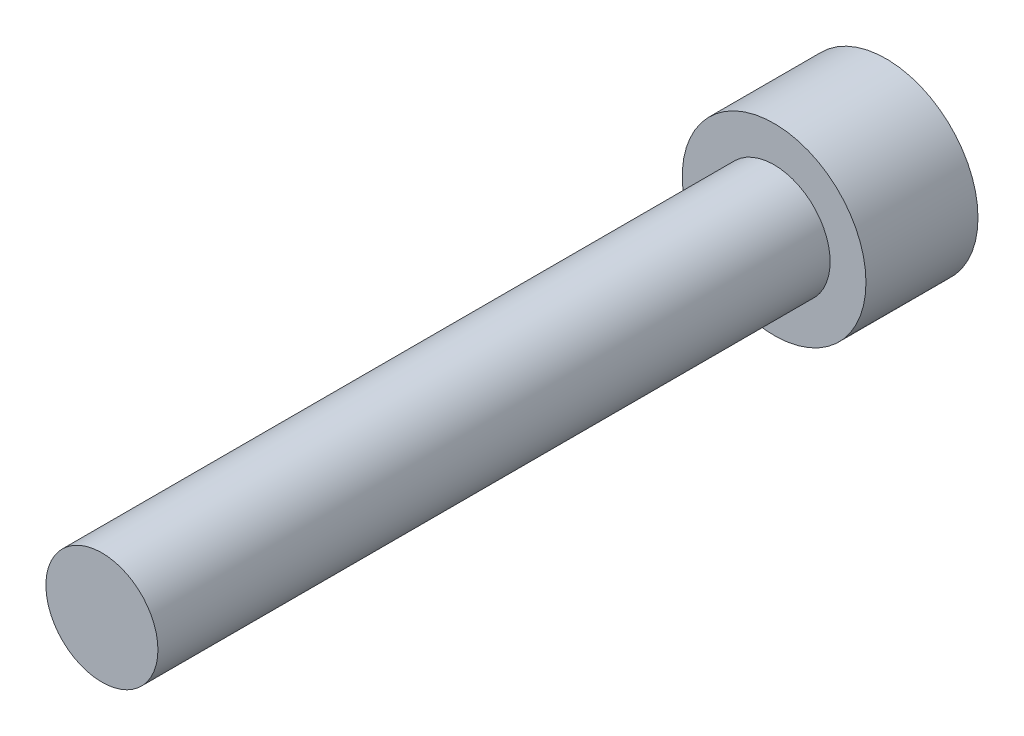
ISO-10303-21;
HEADER;
FILE_DESCRIPTION(('STEP AP214'),'2;1');
FILE_NAME('part.step','',(''),(''),'','','');
FILE_SCHEMA(('AUTOMOTIVE_DESIGN { 1 0 10303 214 1 1 1 1 }'));
ENDSEC;
DATA;
#1=APPLICATION_CONTEXT('core data for automotive mechanical design processes');
#2=APPLICATION_PROTOCOL_DEFINITION('international standard','automotive_design',2000,#1);
#3=PRODUCT_CONTEXT('',#1,'mechanical');
#4=PRODUCT('Part','Part','',(#3));
#5=PRODUCT_RELATED_PRODUCT_CATEGORY('part','',(#4));
#6=PRODUCT_DEFINITION_FORMATION('','',#4);
#7=PRODUCT_DEFINITION_CONTEXT('part definition',#1,'design');
#8=PRODUCT_DEFINITION('design','',#6,#7);
#9=PRODUCT_DEFINITION_SHAPE('','',#8);
#10=(LENGTH_UNIT() NAMED_UNIT(*) SI_UNIT(.MILLI.,.METRE.));
#11=(NAMED_UNIT(*) PLANE_ANGLE_UNIT() SI_UNIT($,.RADIAN.));
#12=(NAMED_UNIT(*) SI_UNIT($,.STERADIAN.) SOLID_ANGLE_UNIT());
#13=UNCERTAINTY_MEASURE_WITH_UNIT(LENGTH_MEASURE(1.E-05),#10,'distance_accuracy_value','');
#14=(GEOMETRIC_REPRESENTATION_CONTEXT(3) GLOBAL_UNCERTAINTY_ASSIGNED_CONTEXT((#13)) GLOBAL_UNIT_ASSIGNED_CONTEXT((#10,
#11,#12)) REPRESENTATION_CONTEXT('',''));
#15=CARTESIAN_POINT('',(0.,0.,0.));
#16=DIRECTION('',(0.,0.,1.));
#17=DIRECTION('',(1.,0.,0.));
#18=AXIS2_PLACEMENT_3D('',#15,#16,#17);
#19=CARTESIAN_POINT('',(0.,0.,19.05));
#20=DIRECTION('',(0.,0.,1.));
#21=DIRECTION('',(1.,0.,0.));
#22=AXIS2_PLACEMENT_3D('',#19,#20,#21);
#23=PLANE('',#22);
#24=CARTESIAN_POINT('',(0.,0.,19.05));
#25=DIRECTION('',(0.,0.,1.));
#26=DIRECTION('',(1.,0.,0.));
#27=AXIS2_PLACEMENT_3D('',#24,#25,#26);
#28=CIRCLE('',#27,1.5875);
#29=CARTESIAN_POINT('',(1.5875,0.,19.05));
#30=VERTEX_POINT('',#29);
#31=EDGE_CURVE('E11',#30,#30,#28,.T.);
#32=ORIENTED_EDGE('',*,*,#31,.T.);
#33=EDGE_LOOP('',(#32));
#34=FACE_BOUND('',#33,.T.);
#35=ADVANCED_FACE('F37',(#34),#23,.T.);
#36=CARTESIAN_POINT('',(0.,0.,19.05));
#37=DIRECTION('',(0.,0.,1.));
#38=DIRECTION('',(1.,0.,0.));
#39=AXIS2_PLACEMENT_3D('',#36,#37,#38);
#40=CYLINDRICAL_SURFACE('',#39,1.5875);
#41=CARTESIAN_POINT('',(0.,0.,0.));
#42=DIRECTION('',(0.,0.,1.));
#43=DIRECTION('',(1.,0.,0.));
#44=AXIS2_PLACEMENT_3D('',#41,#42,#43);
#45=CIRCLE('',#44,1.5875);
#46=CARTESIAN_POINT('',(1.5875,0.,0.));
#47=VERTEX_POINT('',#46);
#48=EDGE_CURVE('E44',#47,#47,#45,.T.);
#49=ORIENTED_EDGE('',*,*,#48,.T.);
#50=EDGE_LOOP('',(#49));
#51=FACE_BOUND('',#50,.T.);
#52=ORIENTED_EDGE('',*,*,#31,.F.);
#53=EDGE_LOOP('',(#52));
#54=FACE_BOUND('',#53,.T.);
#55=ADVANCED_FACE('F151',(#51,#54),#40,.T.);
#56=CARTESIAN_POINT('',(0.,-1.5875,0.));
#57=DIRECTION('',(0.,0.,1.));
#58=DIRECTION('',(1.,0.,0.));
#59=AXIS2_PLACEMENT_3D('',#56,#57,#58);
#60=PLANE('',#59);
#61=CARTESIAN_POINT('',(0.,0.,0.));
#62=DIRECTION('',(0.,0.,1.));
#63=DIRECTION('',(1.,0.,0.));
#64=AXIS2_PLACEMENT_3D('',#61,#62,#63);
#65=CIRCLE('',#64,2.6035);
#66=CARTESIAN_POINT('',(2.6035,0.,0.));
#67=VERTEX_POINT('',#66);
#68=EDGE_CURVE('E146',#67,#67,#65,.T.);
#69=ORIENTED_EDGE('',*,*,#68,.T.);
#70=EDGE_LOOP('',(#69));
#71=FACE_BOUND('',#70,.T.);
#72=ORIENTED_EDGE('',*,*,#48,.F.);
#73=EDGE_LOOP('',(#72));
#74=FACE_BOUND('',#73,.T.);
#75=ADVANCED_FACE('F154',(#71,#74),#60,.T.);
#76=CARTESIAN_POINT('',(0.,0.,19.05));
#77=DIRECTION('',(0.,0.,1.));
#78=DIRECTION('',(1.,0.,0.));
#79=AXIS2_PLACEMENT_3D('',#76,#77,#78);
#80=CYLINDRICAL_SURFACE('',#79,2.6035);
#81=CARTESIAN_POINT('',(0.,0.,-3.175));
#82=DIRECTION('',(0.,0.,1.));
#83=DIRECTION('',(1.,0.,0.));
#84=AXIS2_PLACEMENT_3D('',#81,#82,#83);
#85=CIRCLE('',#84,2.6035);
#86=CARTESIAN_POINT('',(2.6035,0.,-3.175));
#87=VERTEX_POINT('',#86);
#88=EDGE_CURVE('E138',#87,#87,#85,.T.);
#89=ORIENTED_EDGE('',*,*,#88,.T.);
#90=EDGE_LOOP('',(#89));
#91=FACE_BOUND('',#90,.T.);
#92=ORIENTED_EDGE('',*,*,#68,.F.);
#93=EDGE_LOOP('',(#92));
#94=FACE_BOUND('',#93,.T.);
#95=ADVANCED_FACE('F156',(#91,#94),#80,.T.);
#96=CARTESIAN_POINT('',(0.,-2.6035,-3.175));
#97=DIRECTION('',(0.,0.,-1.));
#98=DIRECTION('',(-1.,0.,0.));
#99=AXIS2_PLACEMENT_3D('',#96,#97,#98);
#100=PLANE('',#99);
#101=DIRECTION('',(0.866025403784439,-0.5,0.));
#102=VECTOR('',#101,1.);
#103=CARTESIAN_POINT('',(0.,1.36381680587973,-3.175));
#104=LINE('',#103,#102);
#105=CARTESIAN_POINT('',(0.,1.36381680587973,-3.175));
#106=VERTEX_POINT('',#105);
#107=CARTESIAN_POINT('',(1.1811,0.681908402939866,-3.175));
#108=VERTEX_POINT('',#107);
#109=EDGE_CURVE('E51',#106,#108,#104,.T.);
#110=ORIENTED_EDGE('',*,*,#109,.F.);
#111=DIRECTION('',(0.866025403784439,0.5,0.));
#112=VECTOR('',#111,1.);
#113=CARTESIAN_POINT('',(-1.1811,0.681908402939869,-3.175));
#114=LINE('',#113,#112);
#115=CARTESIAN_POINT('',(-1.1811,0.681908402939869,-3.175));
#116=VERTEX_POINT('',#115);
#117=EDGE_CURVE('E134',#116,#106,#114,.T.);
#118=ORIENTED_EDGE('',*,*,#117,.F.);
#119=DIRECTION('',(0.,1.,0.));
#120=VECTOR('',#119,1.);
#121=CARTESIAN_POINT('',(-1.1811,-0.681908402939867,-3.175));
#122=LINE('',#121,#120);
#123=CARTESIAN_POINT('',(-1.1811,-0.681908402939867,-3.175));
#124=VERTEX_POINT('',#123);
#125=EDGE_CURVE('E132',#124,#116,#122,.T.);
#126=ORIENTED_EDGE('',*,*,#125,.F.);
#127=DIRECTION('',(-0.866025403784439,0.5,0.));
#128=VECTOR('',#127,1.);
#129=CARTESIAN_POINT('',(0.,-1.36381680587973,-3.175));
#130=LINE('',#129,#128);
#131=CARTESIAN_POINT('',(0.,-1.36381680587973,-3.175));
#132=VERTEX_POINT('',#131);
#133=EDGE_CURVE('E99',#132,#124,#130,.T.);
#134=ORIENTED_EDGE('',*,*,#133,.F.);
#135=DIRECTION('',(-0.866025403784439,-0.5,0.));
#136=VECTOR('',#135,1.);
#137=CARTESIAN_POINT('',(1.1811,-0.681908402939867,-3.175));
#138=LINE('',#137,#136);
#139=CARTESIAN_POINT('',(1.1811,-0.681908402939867,-3.175));
#140=VERTEX_POINT('',#139);
#141=EDGE_CURVE('E128',#140,#132,#138,.T.);
#142=ORIENTED_EDGE('',*,*,#141,.F.);
#143=DIRECTION('',(0.,-1.,0.));
#144=VECTOR('',#143,1.);
#145=CARTESIAN_POINT('',(1.1811,0.681908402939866,-3.175));
#146=LINE('',#145,#144);
#147=EDGE_CURVE('E125',#108,#140,#146,.T.);
#148=ORIENTED_EDGE('',*,*,#147,.F.);
#149=EDGE_LOOP('',(#110,#118,#126,#134,#142,#148));
#150=FACE_BOUND('',#149,.T.);
#151=ORIENTED_EDGE('',*,*,#88,.F.);
#152=EDGE_LOOP('',(#151));
#153=FACE_BOUND('',#152,.T.);
#154=ADVANCED_FACE('F163',(#150,#153),#100,.T.);
#155=CARTESIAN_POINT('',(0.,1.36381680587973,-1.397));
#156=DIRECTION('',(0.5,0.866025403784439,0.));
#157=DIRECTION('',(-0.866025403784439,0.5,0.));
#158=AXIS2_PLACEMENT_3D('',#155,#156,#157);
#159=PLANE('',#158);
#160=ORIENTED_EDGE('',*,*,#109,.T.);
#161=DIRECTION('',(0.,0.,-1.));
#162=VECTOR('',#161,1.);
#163=CARTESIAN_POINT('',(1.1811,0.681908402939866,-1.397));
#164=LINE('',#163,#162);
#165=CARTESIAN_POINT('',(1.1811,0.681908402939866,-1.397));
#166=VERTEX_POINT('',#165);
#167=EDGE_CURVE('E81',#166,#108,#164,.T.);
#168=ORIENTED_EDGE('',*,*,#167,.F.);
#169=DIRECTION('',(0.866025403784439,-0.5,0.));
#170=VECTOR('',#169,1.);
#171=CARTESIAN_POINT('',(0.,1.36381680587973,-1.397));
#172=LINE('',#171,#170);
#173=CARTESIAN_POINT('',(0.,1.36381680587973,-1.397));
#174=VERTEX_POINT('',#173);
#175=EDGE_CURVE('E136',#174,#166,#172,.T.);
#176=ORIENTED_EDGE('',*,*,#175,.F.);
#177=DIRECTION('',(0.,0.,-1.));
#178=VECTOR('',#177,1.);
#179=CARTESIAN_POINT('',(0.,1.36381680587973,-1.397));
#180=LINE('',#179,#178);
#181=EDGE_CURVE('E59',#174,#106,#180,.T.);
#182=ORIENTED_EDGE('',*,*,#181,.T.);
#183=EDGE_LOOP('',(#160,#168,#176,#182));
#184=FACE_BOUND('',#183,.T.);
#185=ADVANCED_FACE('F197',(#184),#159,.F.);
#186=CARTESIAN_POINT('',(-1.1811,0.681908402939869,-1.397));
#187=DIRECTION('',(-0.5,0.866025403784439,0.));
#188=DIRECTION('',(-0.866025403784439,-0.5,0.));
#189=AXIS2_PLACEMENT_3D('',#186,#187,#188);
#190=PLANE('',#189);
#191=ORIENTED_EDGE('',*,*,#117,.T.);
#192=ORIENTED_EDGE('',*,*,#181,.F.);
#193=DIRECTION('',(0.866025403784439,0.5,0.));
#194=VECTOR('',#193,1.);
#195=CARTESIAN_POINT('',(-1.1811,0.681908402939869,-1.397));
#196=LINE('',#195,#194);
#197=CARTESIAN_POINT('',(-1.1811,0.681908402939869,-1.397));
#198=VERTEX_POINT('',#197);
#199=EDGE_CURVE('E111',#198,#174,#196,.T.);
#200=ORIENTED_EDGE('',*,*,#199,.F.);
#201=DIRECTION('',(0.,0.,-1.));
#202=VECTOR('',#201,1.);
#203=CARTESIAN_POINT('',(-1.1811,0.681908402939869,-1.397));
#204=LINE('',#203,#202);
#205=EDGE_CURVE('E103',#198,#116,#204,.T.);
#206=ORIENTED_EDGE('',*,*,#205,.T.);
#207=EDGE_LOOP('',(#191,#192,#200,#206));
#208=FACE_BOUND('',#207,.T.);
#209=ADVANCED_FACE('F208',(#208),#190,.F.);
#210=CARTESIAN_POINT('',(-1.1811,-0.681908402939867,-1.397));
#211=DIRECTION('',(-1.,0.,0.));
#212=DIRECTION('',(0.,0.,1.));
#213=AXIS2_PLACEMENT_3D('',#210,#211,#212);
#214=PLANE('',#213);
#215=ORIENTED_EDGE('',*,*,#125,.T.);
#216=ORIENTED_EDGE('',*,*,#205,.F.);
#217=DIRECTION('',(0.,1.,0.));
#218=VECTOR('',#217,1.);
#219=CARTESIAN_POINT('',(-1.1811,-0.681908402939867,-1.397));
#220=LINE('',#219,#218);
#221=CARTESIAN_POINT('',(-1.1811,-0.681908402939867,-1.397));
#222=VERTEX_POINT('',#221);
#223=EDGE_CURVE('E107',#222,#198,#220,.T.);
#224=ORIENTED_EDGE('',*,*,#223,.F.);
#225=DIRECTION('',(0.,0.,-1.));
#226=VECTOR('',#225,1.);
#227=CARTESIAN_POINT('',(-1.1811,-0.681908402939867,-1.397));
#228=LINE('',#227,#226);
#229=EDGE_CURVE('E92',#222,#124,#228,.T.);
#230=ORIENTED_EDGE('',*,*,#229,.T.);
#231=EDGE_LOOP('',(#215,#216,#224,#230));
#232=FACE_BOUND('',#231,.T.);
#233=ADVANCED_FACE('F108',(#232),#214,.F.);
#234=CARTESIAN_POINT('',(0.,-1.36381680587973,-1.397));
#235=DIRECTION('',(-0.5,-0.866025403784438,0.));
#236=DIRECTION('',(0.866025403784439,-0.5,0.));
#237=AXIS2_PLACEMENT_3D('',#234,#235,#236);
#238=PLANE('',#237);
#239=ORIENTED_EDGE('',*,*,#133,.T.);
#240=ORIENTED_EDGE('',*,*,#229,.F.);
#241=DIRECTION('',(-0.866025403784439,0.5,0.));
#242=VECTOR('',#241,1.);
#243=CARTESIAN_POINT('',(0.,-1.36381680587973,-1.397));
#244=LINE('',#243,#242);
#245=CARTESIAN_POINT('',(0.,-1.36381680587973,-1.397));
#246=VERTEX_POINT('',#245);
#247=EDGE_CURVE('E96',#246,#222,#244,.T.);
#248=ORIENTED_EDGE('',*,*,#247,.F.);
#249=DIRECTION('',(0.,0.,-1.));
#250=VECTOR('',#249,1.);
#251=CARTESIAN_POINT('',(0.,-1.36381680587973,-1.397));
#252=LINE('',#251,#250);
#253=EDGE_CURVE('E104',#246,#132,#252,.T.);
#254=ORIENTED_EDGE('',*,*,#253,.T.);
#255=EDGE_LOOP('',(#239,#240,#248,#254));
#256=FACE_BOUND('',#255,.T.);
#257=ADVANCED_FACE('F94',(#256),#238,.F.);
#258=CARTESIAN_POINT('',(1.1811,-0.681908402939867,-1.397));
#259=DIRECTION('',(0.5,-0.866025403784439,0.));
#260=DIRECTION('',(0.866025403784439,0.5,0.));
#261=AXIS2_PLACEMENT_3D('',#258,#259,#260);
#262=PLANE('',#261);
#263=ORIENTED_EDGE('',*,*,#141,.T.);
#264=ORIENTED_EDGE('',*,*,#253,.F.);
#265=DIRECTION('',(-0.866025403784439,-0.5,0.));
#266=VECTOR('',#265,1.);
#267=CARTESIAN_POINT('',(1.1811,-0.681908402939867,-1.397));
#268=LINE('',#267,#266);
#269=CARTESIAN_POINT('',(1.1811,-0.681908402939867,-1.397));
#270=VERTEX_POINT('',#269);
#271=EDGE_CURVE('E117',#270,#246,#268,.T.);
#272=ORIENTED_EDGE('',*,*,#271,.F.);
#273=DIRECTION('',(0.,0.,-1.));
#274=VECTOR('',#273,1.);
#275=CARTESIAN_POINT('',(1.1811,-0.681908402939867,-1.397));
#276=LINE('',#275,#274);
#277=EDGE_CURVE('E141',#270,#140,#276,.T.);
#278=ORIENTED_EDGE('',*,*,#277,.T.);
#279=EDGE_LOOP('',(#263,#264,#272,#278));
#280=FACE_BOUND('',#279,.T.);
#281=ADVANCED_FACE('F236',(#280),#262,.F.);
#282=CARTESIAN_POINT('',(1.1811,0.681908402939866,-1.397));
#283=DIRECTION('',(1.,0.,0.));
#284=DIRECTION('',(0.,1.,0.));
#285=AXIS2_PLACEMENT_3D('',#282,#283,#284);
#286=PLANE('',#285);
#287=ORIENTED_EDGE('',*,*,#147,.T.);
#288=ORIENTED_EDGE('',*,*,#277,.F.);
#289=DIRECTION('',(0.,-1.,0.));
#290=VECTOR('',#289,1.);
#291=CARTESIAN_POINT('',(1.1811,0.681908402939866,-1.397));
#292=LINE('',#291,#290);
#293=EDGE_CURVE('E119',#166,#270,#292,.T.);
#294=ORIENTED_EDGE('',*,*,#293,.F.);
#295=ORIENTED_EDGE('',*,*,#167,.T.);
#296=EDGE_LOOP('',(#287,#288,#294,#295));
#297=FACE_BOUND('',#296,.T.);
#298=ADVANCED_FACE('F246',(#297),#286,.F.);
#299=CARTESIAN_POINT('',(1.1811,0.681908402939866,-1.397));
#300=DIRECTION('',(0.,0.,-1.));
#301=DIRECTION('',(-1.,0.,0.));
#302=AXIS2_PLACEMENT_3D('',#299,#300,#301);
#303=PLANE('',#302);
#304=ORIENTED_EDGE('',*,*,#175,.T.);
#305=ORIENTED_EDGE('',*,*,#293,.T.);
#306=ORIENTED_EDGE('',*,*,#271,.T.);
#307=ORIENTED_EDGE('',*,*,#247,.T.);
#308=ORIENTED_EDGE('',*,*,#223,.T.);
#309=ORIENTED_EDGE('',*,*,#199,.T.);
#310=EDGE_LOOP('',(#304,#305,#306,#307,#308,#309));
#311=FACE_BOUND('',#310,.T.);
#312=ADVANCED_FACE('F114',(#311),#303,.T.);
#313=CLOSED_SHELL('',(#35,#55,#75,#95,#154,#185,#209,#233,#257,#281,#298,#312));
#314=MANIFOLD_SOLID_BREP('B2',#313);
#315=ADVANCED_BREP_SHAPE_REPRESENTATION('',(#18,#314),#14);
#316=SHAPE_DEFINITION_REPRESENTATION(#9,#315);
ENDSEC;
END-ISO-10303-21;
